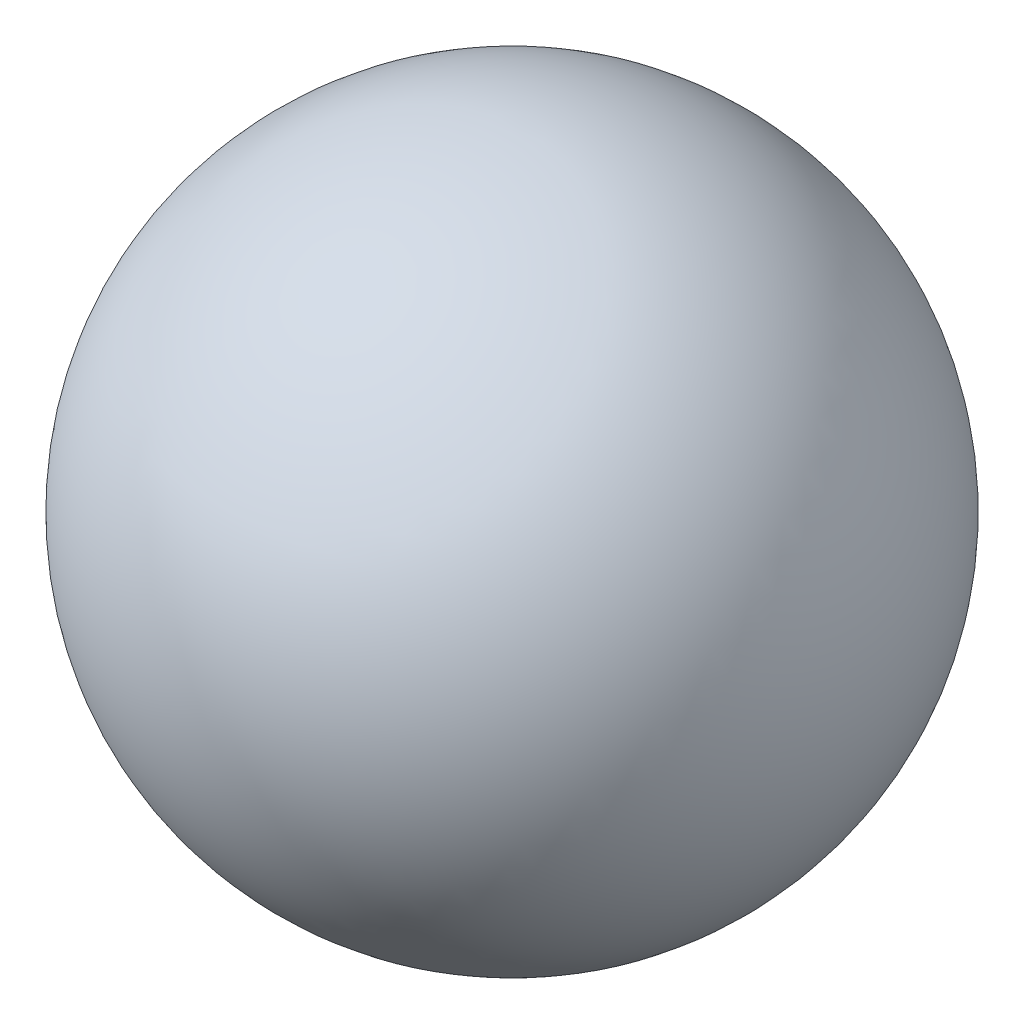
from build123d import *


with BuildPart() as part:
    # Sketch1 → Revolve1 (revolve)
    with BuildSketch(Plane.XY):
        with BuildLine():
            Line((0, 32.639), (0, -32.639))
            ThreePointArc((0, -32.639), (32.639, 0), (0, 32.639))
        make_face()
    revolve(axis=Axis((0, 32.639, 0), (0, -1, 0)))


solid = part.part
